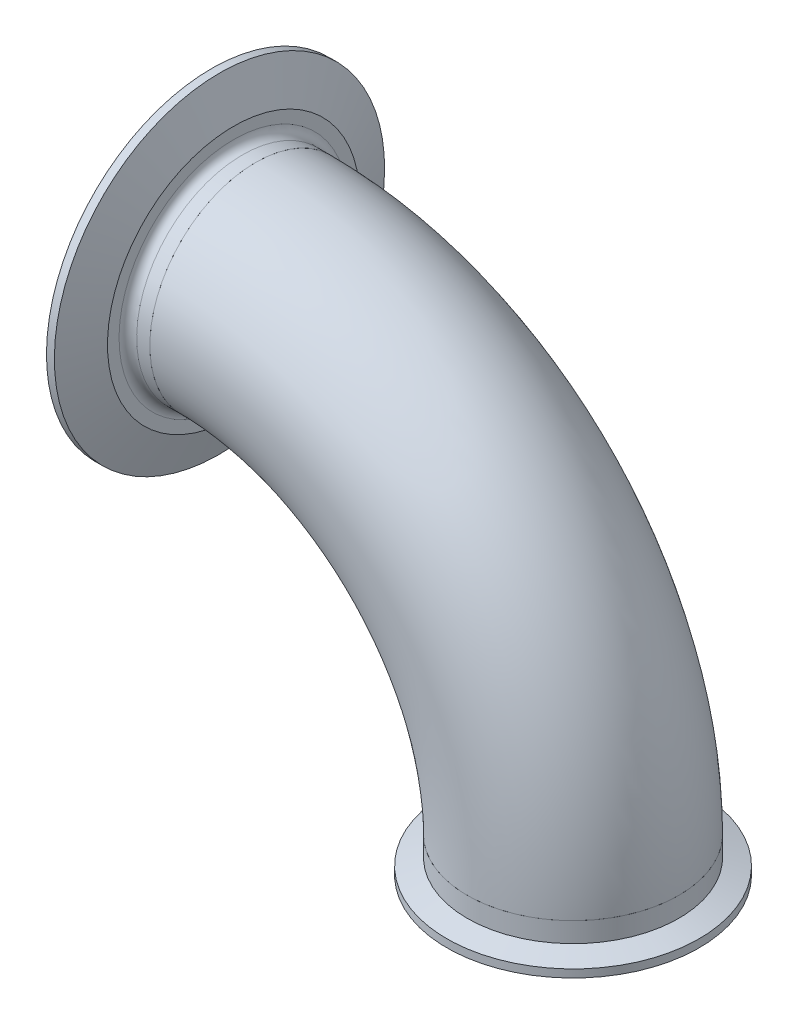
ISO-10303-21;
HEADER;
FILE_DESCRIPTION(('STEP AP214'),'2;1');
FILE_NAME('part.step','',(''),(''),'','','');
FILE_SCHEMA(('AUTOMOTIVE_DESIGN { 1 0 10303 214 1 1 1 1 }'));
ENDSEC;
DATA;
#1=APPLICATION_CONTEXT('core data for automotive mechanical design processes');
#2=APPLICATION_PROTOCOL_DEFINITION('international standard','automotive_design',2000,#1);
#3=PRODUCT_CONTEXT('',#1,'mechanical');
#4=PRODUCT('Part','Part','',(#3));
#5=PRODUCT_RELATED_PRODUCT_CATEGORY('part','',(#4));
#6=PRODUCT_DEFINITION_FORMATION('','',#4);
#7=PRODUCT_DEFINITION_CONTEXT('part definition',#1,'design');
#8=PRODUCT_DEFINITION('design','',#6,#7);
#9=PRODUCT_DEFINITION_SHAPE('','',#8);
#10=(LENGTH_UNIT() NAMED_UNIT(*) SI_UNIT(.MILLI.,.METRE.));
#11=(NAMED_UNIT(*) PLANE_ANGLE_UNIT() SI_UNIT($,.RADIAN.));
#12=(NAMED_UNIT(*) SI_UNIT($,.STERADIAN.) SOLID_ANGLE_UNIT());
#13=UNCERTAINTY_MEASURE_WITH_UNIT(LENGTH_MEASURE(1.E-05),#10,'distance_accuracy_value','');
#14=(GEOMETRIC_REPRESENTATION_CONTEXT(3) GLOBAL_UNCERTAINTY_ASSIGNED_CONTEXT((#13)) GLOBAL_UNIT_ASSIGNED_CONTEXT((#10,
#11,#12)) REPRESENTATION_CONTEXT('',''));
#15=CARTESIAN_POINT('',(0.,0.,0.));
#16=DIRECTION('',(0.,0.,1.));
#17=DIRECTION('',(1.,0.,0.));
#18=AXIS2_PLACEMENT_3D('',#15,#16,#17);
#19=CARTESIAN_POINT('',(23.2453005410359,191.163161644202,175.928638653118));
#20=DIRECTION('',(-1.,0.,0.));
#21=DIRECTION('',(0.,0.487244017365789,-0.873265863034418));
#22=AXIS2_PLACEMENT_3D('',#19,#20,#21);
#23=PLANE('',#22);
#24=CARTESIAN_POINT('',(23.2453005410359,159.33349420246,158.169081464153));
#25=DIRECTION('',(-1.,0.,0.));
#26=DIRECTION('',(0.,0.487244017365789,-0.873265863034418));
#27=AXIS2_PLACEMENT_3D('',#24,#25,#26);
#28=CIRCLE('',#27,38.1);
#29=CARTESIAN_POINT('',(23.2453005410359,177.897491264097,124.897652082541));
#30=VERTEX_POINT('',#29);
#31=EDGE_CURVE('P0_E9',#30,#30,#28,.T.);
#32=ORIENTED_EDGE('',*,*,#31,.F.);
#33=EDGE_LOOP('',(#32));
#34=FACE_BOUND('',#33,.T.);
#35=CARTESIAN_POINT('',(23.2453005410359,159.33349420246,158.169081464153));
#36=DIRECTION('',(-1.,0.,0.));
#37=DIRECTION('',(0.,0.487244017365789,-0.873265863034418));
#38=AXIS2_PLACEMENT_3D('',#35,#36,#37);
#39=CIRCLE('',#38,36.449);
#40=CARTESIAN_POINT('',(23.2453005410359,177.093051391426,126.339414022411));
#41=VERTEX_POINT('',#40);
#42=EDGE_CURVE('P0_E63',#41,#41,#39,.T.);
#43=ORIENTED_EDGE('',*,*,#42,.T.);
#44=EDGE_LOOP('',(#43));
#45=FACE_BOUND('',#44,.T.);
#46=ADVANCED_FACE('P0_F14',(#34,#45),#23,.F.);
#47=CARTESIAN_POINT('',(7.37030054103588,159.33349420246,158.169081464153));
#48=DIRECTION('',(-1.,0.,0.));
#49=DIRECTION('',(0.,0.487244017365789,-0.873265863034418));
#50=AXIS2_PLACEMENT_3D('',#47,#48,#49);
#51=CYLINDRICAL_SURFACE('',#50,38.1);
#52=CARTESIAN_POINT('',(18.4955005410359,159.33349420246,158.169081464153));
#53=DIRECTION('',(-1.,0.,0.));
#54=DIRECTION('',(0.,0.487244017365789,-0.873265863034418));
#55=AXIS2_PLACEMENT_3D('',#52,#53,#54);
#56=CIRCLE('',#55,38.1);
#57=CARTESIAN_POINT('',(18.4955005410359,177.897491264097,124.897652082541));
#58=VERTEX_POINT('',#57);
#59=EDGE_CURVE('P0_E20',#58,#58,#56,.T.);
#60=ORIENTED_EDGE('',*,*,#59,.F.);
#61=EDGE_LOOP('',(#60));
#62=FACE_BOUND('',#61,.T.);
#63=ORIENTED_EDGE('',*,*,#31,.T.);
#64=EDGE_LOOP('',(#63));
#65=FACE_BOUND('',#64,.T.);
#66=ADVANCED_FACE('P0_F142',(#62,#65),#51,.T.);
#67=CARTESIAN_POINT('',(18.4955005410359,159.33349420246,158.169081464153));
#68=DIRECTION('',(-1.,0.,0.));
#69=DIRECTION('',(0.,0.487244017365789,-0.873265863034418));
#70=AXIS2_PLACEMENT_3D('',#67,#68,#69);
#71=TOROIDAL_SURFACE('',#70,41.275,3.175);
#72=CARTESIAN_POINT('',(15.3205005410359,159.33349420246,158.169081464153));
#73=DIRECTION('',(-1.,0.,0.));
#74=DIRECTION('',(0.,0.487244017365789,-0.873265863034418));
#75=AXIS2_PLACEMENT_3D('',#72,#73,#74);
#76=CIRCLE('',#75,41.275);
#77=CARTESIAN_POINT('',(15.3205005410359,179.444491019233,122.125032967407));
#78=VERTEX_POINT('',#77);
#79=EDGE_CURVE('P0_E24',#78,#78,#76,.T.);
#80=ORIENTED_EDGE('',*,*,#79,.F.);
#81=EDGE_LOOP('',(#80));
#82=FACE_BOUND('',#81,.T.);
#83=ORIENTED_EDGE('',*,*,#59,.T.);
#84=EDGE_LOOP('',(#83));
#85=FACE_BOUND('',#84,.T.);
#86=ADVANCED_FACE('P0_F137',(#82,#85),#71,.F.);
#87=CARTESIAN_POINT('',(15.3205005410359,195.377542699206,178.280078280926));
#88=DIRECTION('',(-1.,0.,0.));
#89=DIRECTION('',(0.,0.487244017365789,-0.873265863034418));
#90=AXIS2_PLACEMENT_3D('',#87,#88,#89);
#91=PLANE('',#90);
#92=CARTESIAN_POINT('',(15.3205005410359,159.33349420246,158.169081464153));
#93=DIRECTION('',(-1.,0.,0.));
#94=DIRECTION('',(0.,0.487244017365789,-0.873265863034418));
#95=AXIS2_PLACEMENT_3D('',#92,#93,#94);
#96=CIRCLE('',#95,45.4344287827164);
#97=CARTESIAN_POINT('',(15.3205005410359,181.471147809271,118.492745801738));
#98=VERTEX_POINT('',#97);
#99=EDGE_CURVE('P0_E28',#98,#98,#96,.T.);
#100=ORIENTED_EDGE('',*,*,#99,.F.);
#101=EDGE_LOOP('',(#100));
#102=FACE_BOUND('',#101,.T.);
#103=ORIENTED_EDGE('',*,*,#79,.T.);
#104=EDGE_LOOP('',(#103));
#105=FACE_BOUND('',#104,.T.);
#106=ADVANCED_FACE('P0_F131',(#102,#105),#91,.F.);
#107=CARTESIAN_POINT('',(15.3205005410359,159.33349420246,158.169081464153));
#108=DIRECTION('',(-1.,0.,0.));
#109=DIRECTION('',(0.,0.487244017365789,-0.873265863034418));
#110=AXIS2_PLACEMENT_3D('',#107,#108,#109);
#111=CONICAL_SURFACE('',#110,45.4344287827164,1.22173047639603);
#112=CARTESIAN_POINT('',(10.2151005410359,159.33349420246,158.169081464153));
#113=DIRECTION('',(-1.,0.,0.));
#114=DIRECTION('',(0.,0.487244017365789,-0.873265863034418));
#115=AXIS2_PLACEMENT_3D('',#112,#113,#114);
#116=CIRCLE('',#115,59.4614);
#117=CARTESIAN_POINT('',(10.2151005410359,188.305705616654,106.243470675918));
#118=VERTEX_POINT('',#117);
#119=EDGE_CURVE('P0_E33',#118,#118,#116,.T.);
#120=ORIENTED_EDGE('',*,*,#119,.F.);
#121=EDGE_LOOP('',(#120));
#122=FACE_BOUND('',#121,.T.);
#123=ORIENTED_EDGE('',*,*,#99,.T.);
#124=EDGE_LOOP('',(#123));
#125=FACE_BOUND('',#124,.T.);
#126=ADVANCED_FACE('P0_F125',(#122,#125),#111,.T.);
#127=CARTESIAN_POINT('',(7.37030054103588,159.33349420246,158.169081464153));
#128=DIRECTION('',(-1.,0.,0.));
#129=DIRECTION('',(0.,0.487244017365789,-0.873265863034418));
#130=AXIS2_PLACEMENT_3D('',#127,#128,#129);
#131=CYLINDRICAL_SURFACE('',#130,59.4614);
#132=CARTESIAN_POINT('',(7.37030054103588,159.33349420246,158.169081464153));
#133=DIRECTION('',(-1.,0.,0.));
#134=DIRECTION('',(0.,0.487244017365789,-0.873265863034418));
#135=AXIS2_PLACEMENT_3D('',#132,#133,#134);
#136=CIRCLE('',#135,59.4614);
#137=CARTESIAN_POINT('',(7.37030054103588,188.305705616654,106.243470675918));
#138=VERTEX_POINT('',#137);
#139=EDGE_CURVE('P0_E36',#138,#138,#136,.T.);
#140=ORIENTED_EDGE('',*,*,#139,.F.);
#141=EDGE_LOOP('',(#140));
#142=FACE_BOUND('',#141,.T.);
#143=ORIENTED_EDGE('',*,*,#119,.T.);
#144=EDGE_LOOP('',(#143));
#145=FACE_BOUND('',#144,.T.);
#146=ADVANCED_FACE('P0_F119',(#142,#145),#131,.T.);
#147=CARTESIAN_POINT('',(7.37030054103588,211.259104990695,187.141292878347));
#148=DIRECTION('',(1.,0.,0.));
#149=DIRECTION('',(0.,-0.487244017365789,0.873265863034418));
#150=AXIS2_PLACEMENT_3D('',#147,#148,#149);
#151=PLANE('',#150);
#152=CARTESIAN_POINT('',(7.37030054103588,159.33349420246,158.169081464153));
#153=DIRECTION('',(-1.,0.,0.));
#154=DIRECTION('',(0.,0.487244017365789,-0.873265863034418));
#155=AXIS2_PLACEMENT_3D('',#152,#153,#154);
#156=CIRCLE('',#155,56.924857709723);
#157=CARTESIAN_POINT('',(7.37030054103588,187.069790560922,108.45854646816));
#158=VERTEX_POINT('',#157);
#159=EDGE_CURVE('P0_E39',#158,#158,#156,.T.);
#160=ORIENTED_EDGE('',*,*,#159,.F.);
#161=EDGE_LOOP('',(#160));
#162=FACE_BOUND('',#161,.T.);
#163=ORIENTED_EDGE('',*,*,#139,.T.);
#164=EDGE_LOOP('',(#163));
#165=FACE_BOUND('',#164,.T.);
#166=ADVANCED_FACE('P0_F113',(#162,#165),#151,.F.);
#167=CARTESIAN_POINT('',(8.14701976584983,159.33349420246,158.169081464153));
#168=DIRECTION('',(-1.,0.,0.));
#169=DIRECTION('',(0.,0.487244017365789,-0.873265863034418));
#170=AXIS2_PLACEMENT_3D('',#167,#168,#169);
#171=TOROIDAL_SURFACE('',#170,56.7956059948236,0.787400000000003);
#172=CARTESIAN_POINT('',(7.83935807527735,159.33349420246,158.169081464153));
#173=DIRECTION('',(-1.,0.,0.));
#174=DIRECTION('',(0.,0.487244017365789,-0.873265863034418));
#175=AXIS2_PLACEMENT_3D('',#172,#173,#174);
#176=CIRCLE('',#175,56.0708004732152);
#177=CARTESIAN_POINT('',(7.83935807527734,186.653656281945,109.20436549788));
#178=VERTEX_POINT('',#177);
#179=EDGE_CURVE('P0_E42',#178,#178,#176,.T.);
#180=ORIENTED_EDGE('',*,*,#179,.F.);
#181=EDGE_LOOP('',(#180));
#182=FACE_BOUND('',#181,.T.);
#183=ORIENTED_EDGE('',*,*,#159,.T.);
#184=EDGE_LOOP('',(#183));
#185=FACE_BOUND('',#184,.T.);
#186=ADVANCED_FACE('P0_F107',(#182,#185),#171,.T.);
#187=CARTESIAN_POINT('',(7.83935807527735,159.33349420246,158.169081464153));
#188=DIRECTION('',(-1.,0.,0.));
#189=DIRECTION('',(0.,0.487244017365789,-0.873265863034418));
#190=AXIS2_PLACEMENT_3D('',#187,#188,#189);
#191=CONICAL_SURFACE('',#190,56.0708004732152,0.401425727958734);
#192=CARTESIAN_POINT('',(8.24315536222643,159.33349420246,158.169081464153));
#193=DIRECTION('',(-1.,0.,0.));
#194=DIRECTION('',(0.,0.487244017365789,-0.873265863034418));
#195=AXIS2_PLACEMENT_3D('',#192,#193,#194);
#196=CIRCLE('',#195,55.8993986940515);
#197=CARTESIAN_POINT('',(8.24315536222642,186.570141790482,109.354044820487));
#198=VERTEX_POINT('',#197);
#199=EDGE_CURVE('P0_E45',#198,#198,#196,.T.);
#200=ORIENTED_EDGE('',*,*,#199,.F.);
#201=EDGE_LOOP('',(#200));
#202=FACE_BOUND('',#201,.T.);
#203=ORIENTED_EDGE('',*,*,#179,.T.);
#204=EDGE_LOOP('',(#203));
#205=FACE_BOUND('',#204,.T.);
#206=ADVANCED_FACE('P0_F101',(#202,#205),#191,.F.);
#207=CARTESIAN_POINT('',(7.77670054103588,159.33349420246,158.169081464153));
#208=DIRECTION('',(-1.,0.,0.));
#209=DIRECTION('',(0.,0.487244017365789,-0.873265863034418));
#210=AXIS2_PLACEMENT_3D('',#207,#208,#209);
#211=TOROIDAL_SURFACE('',#210,54.8005,1.1938);
#212=CARTESIAN_POINT('',(8.24315536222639,159.33349420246,158.169081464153));
#213=DIRECTION('',(-1.,0.,0.));
#214=DIRECTION('',(0.,0.487244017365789,-0.873265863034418));
#215=AXIS2_PLACEMENT_3D('',#212,#213,#214);
#216=CIRCLE('',#215,53.7016013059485);
#217=CARTESIAN_POINT('',(8.24315536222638,185.499278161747,111.273306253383));
#218=VERTEX_POINT('',#217);
#219=EDGE_CURVE('P0_E48',#218,#218,#216,.T.);
#220=ORIENTED_EDGE('',*,*,#219,.F.);
#221=EDGE_LOOP('',(#220));
#222=FACE_BOUND('',#221,.T.);
#223=ORIENTED_EDGE('',*,*,#199,.T.);
#224=EDGE_LOOP('',(#223));
#225=FACE_BOUND('',#224,.T.);
#226=ADVANCED_FACE('P0_F95',(#222,#225),#211,.F.);
#227=CARTESIAN_POINT('',(8.24315536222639,159.33349420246,158.169081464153));
#228=DIRECTION('',(1.,0.,0.));
#229=DIRECTION('',(0.,-0.487244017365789,0.873265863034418));
#230=AXIS2_PLACEMENT_3D('',#227,#228,#229);
#231=CONICAL_SURFACE('',#230,53.7016013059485,0.401425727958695);
#232=CARTESIAN_POINT('',(7.85003885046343,159.33349420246,158.169081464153));
#233=DIRECTION('',(-1.,0.,0.));
#234=DIRECTION('',(0.,0.487244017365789,-0.873265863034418));
#235=AXIS2_PLACEMENT_3D('',#232,#233,#234);
#236=CIRCLE('',#235,53.5347332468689);
#237=CARTESIAN_POINT('',(7.85003885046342,185.417972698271,111.419026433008));
#238=VERTEX_POINT('',#237);
#239=EDGE_CURVE('P0_E51',#238,#238,#236,.T.);
#240=ORIENTED_EDGE('',*,*,#239,.F.);
#241=EDGE_LOOP('',(#240));
#242=FACE_BOUND('',#241,.T.);
#243=ORIENTED_EDGE('',*,*,#219,.T.);
#244=EDGE_LOOP('',(#243));
#245=FACE_BOUND('',#244,.T.);
#246=ADVANCED_FACE('P0_F89',(#242,#245),#231,.T.);
#247=CARTESIAN_POINT('',(8.15770054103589,159.33349420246,158.169081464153));
#248=DIRECTION('',(-1.,0.,0.));
#249=DIRECTION('',(0.,0.487244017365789,-0.873265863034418));
#250=AXIS2_PLACEMENT_3D('',#247,#248,#249);
#251=TOROIDAL_SURFACE('',#250,52.8099277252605,0.787399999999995);
#252=CARTESIAN_POINT('',(7.37030054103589,159.33349420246,158.169081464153));
#253=DIRECTION('',(-1.,0.,0.));
#254=DIRECTION('',(0.,0.487244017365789,-0.873265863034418));
#255=AXIS2_PLACEMENT_3D('',#252,#253,#254);
#256=CIRCLE('',#255,52.8099277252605);
#257=CARTESIAN_POINT('',(7.37030054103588,185.064815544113,112.051974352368));
#258=VERTEX_POINT('',#257);
#259=EDGE_CURVE('P0_E54',#258,#258,#256,.T.);
#260=ORIENTED_EDGE('',*,*,#259,.F.);
#261=EDGE_LOOP('',(#260));
#262=FACE_BOUND('',#261,.T.);
#263=ORIENTED_EDGE('',*,*,#239,.T.);
#264=EDGE_LOOP('',(#263));
#265=FACE_BOUND('',#264,.T.);
#266=ADVANCED_FACE('P0_F83',(#262,#265),#251,.T.);
#267=CARTESIAN_POINT('',(7.37030054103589,201.85438095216,181.893869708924));
#268=DIRECTION('',(1.,0.,0.));
#269=DIRECTION('',(0.,-0.487244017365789,0.873265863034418));
#270=AXIS2_PLACEMENT_3D('',#267,#268,#269);
#271=PLANE('',#270);
#272=CARTESIAN_POINT('',(7.37030054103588,159.33349420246,158.169081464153));
#273=DIRECTION('',(-1.,0.,0.));
#274=DIRECTION('',(0.,0.487244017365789,-0.873265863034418));
#275=AXIS2_PLACEMENT_3D('',#272,#273,#274);
#276=CIRCLE('',#275,48.6918);
#277=CARTESIAN_POINT('',(7.37030054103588,183.058282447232,115.648194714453));
#278=VERTEX_POINT('',#277);
#279=EDGE_CURVE('P0_E57',#278,#278,#276,.T.);
#280=ORIENTED_EDGE('',*,*,#279,.F.);
#281=EDGE_LOOP('',(#280));
#282=FACE_BOUND('',#281,.T.);
#283=ORIENTED_EDGE('',*,*,#259,.T.);
#284=EDGE_LOOP('',(#283));
#285=FACE_BOUND('',#284,.T.);
#286=ADVANCED_FACE('P0_F77',(#282,#285),#271,.F.);
#287=CARTESIAN_POINT('',(7.37030054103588,159.33349420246,158.169081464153));
#288=DIRECTION('',(-1.,0.,0.));
#289=DIRECTION('',(0.,0.487244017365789,-0.873265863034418));
#290=AXIS2_PLACEMENT_3D('',#287,#288,#289);
#291=CONICAL_SURFACE('',#290,48.6918,0.958185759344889);
#292=CARTESIAN_POINT('',(15.9746844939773,159.33349420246,158.169081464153));
#293=DIRECTION('',(-1.,0.,0.));
#294=DIRECTION('',(0.,0.487244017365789,-0.873265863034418));
#295=AXIS2_PLACEMENT_3D('',#292,#293,#294);
#296=CIRCLE('',#295,36.449);
#297=CARTESIAN_POINT('',(15.9746844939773,177.093051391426,126.339414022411));
#298=VERTEX_POINT('',#297);
#299=EDGE_CURVE('P0_E60',#298,#298,#296,.T.);
#300=ORIENTED_EDGE('',*,*,#299,.F.);
#301=EDGE_LOOP('',(#300));
#302=FACE_BOUND('',#301,.T.);
#303=ORIENTED_EDGE('',*,*,#279,.T.);
#304=EDGE_LOOP('',(#303));
#305=FACE_BOUND('',#304,.T.);
#306=ADVANCED_FACE('P0_F71',(#302,#305),#291,.F.);
#307=CARTESIAN_POINT('',(7.37030054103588,159.33349420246,158.169081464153));
#308=DIRECTION('',(-1.,0.,0.));
#309=DIRECTION('',(0.,0.487244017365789,-0.873265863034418));
#310=AXIS2_PLACEMENT_3D('',#307,#308,#309);
#311=CYLINDRICAL_SURFACE('',#310,36.449);
#312=ORIENTED_EDGE('',*,*,#42,.F.);
#313=EDGE_LOOP('',(#312));
#314=FACE_BOUND('',#313,.T.);
#315=ORIENTED_EDGE('',*,*,#299,.T.);
#316=EDGE_LOOP('',(#315));
#317=FACE_BOUND('',#316,.T.);
#318=ADVANCED_FACE('P0_F68',(#314,#317),#311,.F.);
#319=CLOSED_SHELL('',(#46,#66,#86,#106,#126,#146,#166,#186,#206,#226,#246,#266,#286,#306,#318));
#320=MANIFOLD_SOLID_BREP('P0_B1',#319);
#321=CARTESIAN_POINT('',(137.545300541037,33.1208942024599,158.169081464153));
#322=DIRECTION('',(0.,-1.00000000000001,0.));
#323=DIRECTION('',(0.,0.,-1.));
#324=AXIS2_PLACEMENT_3D('',#321,#322,#323);
#325=TOROIDAL_SURFACE('',#324,43.4867084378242,0.787400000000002);
#326=CARTESIAN_POINT('',(137.545300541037,32.3334942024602,158.169081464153));
#327=DIRECTION('',(0.,-1.00000000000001,0.));
#328=DIRECTION('',(0.,0.,-1.));
#329=AXIS2_PLACEMENT_3D('',#326,#327,#328);
#330=CIRCLE('',#329,43.4867084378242);
#331=CARTESIAN_POINT('',(137.545300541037,32.3334942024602,114.682373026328));
#332=VERTEX_POINT('',#331);
#333=EDGE_CURVE('P1_E49',#332,#332,#330,.T.);
#334=ORIENTED_EDGE('',*,*,#333,.T.);
#335=EDGE_LOOP('',(#334));
#336=FACE_BOUND('',#335,.T.);
#337=CARTESIAN_POINT('',(137.545300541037,32.8079531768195,158.169081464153));
#338=DIRECTION('',(0.,-1.00000000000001,0.));
#339=DIRECTION('',(0.,0.,-1.));
#340=AXIS2_PLACEMENT_3D('',#337,#338,#339);
#341=CIRCLE('',#340,42.7641666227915);
#342=CARTESIAN_POINT('',(137.545300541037,32.8079531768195,115.404914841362));
#343=VERTEX_POINT('',#342);
#344=EDGE_CURVE('P1_E10',#343,#343,#341,.T.);
#345=ORIENTED_EDGE('',*,*,#344,.F.);
#346=EDGE_LOOP('',(#345));
#347=FACE_BOUND('',#346,.T.);
#348=ADVANCED_FACE('P1_F15',(#336,#347),#325,.T.);
#349=CARTESIAN_POINT('',(137.545300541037,32.3334942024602,158.169081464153));
#350=DIRECTION('',(0.,-1.00000000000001,0.));
#351=DIRECTION('',(0.,0.,-1.));
#352=AXIS2_PLACEMENT_3D('',#349,#350,#351);
#353=TOROIDAL_SURFACE('',#352,41.6687,1.1938);
#354=CARTESIAN_POINT('',(137.545300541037,32.8079531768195,158.169081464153));
#355=DIRECTION('',(0.,-1.00000000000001,0.));
#356=DIRECTION('',(0.,0.,-1.));
#357=AXIS2_PLACEMENT_3D('',#354,#355,#356);
#358=CIRCLE('',#357,40.5732333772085);
#359=CARTESIAN_POINT('',(137.545300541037,32.8079531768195,117.595848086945));
#360=VERTEX_POINT('',#359);
#361=EDGE_CURVE('P1_E21',#360,#360,#358,.T.);
#362=ORIENTED_EDGE('',*,*,#361,.F.);
#363=EDGE_LOOP('',(#362));
#364=FACE_BOUND('',#363,.T.);
#365=ORIENTED_EDGE('',*,*,#344,.T.);
#366=EDGE_LOOP('',(#365));
#367=FACE_BOUND('',#366,.T.);
#368=ADVANCED_FACE('P1_F98',(#364,#367),#353,.F.);
#369=CARTESIAN_POINT('',(137.545300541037,33.1208942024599,158.169081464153));
#370=DIRECTION('',(0.,-1.00000000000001,0.));
#371=DIRECTION('',(0.,0.,-1.));
#372=AXIS2_PLACEMENT_3D('',#369,#370,#371);
#373=TOROIDAL_SURFACE('',#372,39.8506915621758,0.787399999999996);
#374=ORIENTED_EDGE('',*,*,#361,.T.);
#375=EDGE_LOOP('',(#374));
#376=FACE_BOUND('',#375,.T.);
#377=CARTESIAN_POINT('',(137.545300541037,32.3334942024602,158.169081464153));
#378=DIRECTION('',(0.,-1.00000000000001,0.));
#379=DIRECTION('',(0.,0.,-1.));
#380=AXIS2_PLACEMENT_3D('',#377,#378,#379);
#381=CIRCLE('',#380,39.8506915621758);
#382=CARTESIAN_POINT('',(137.545300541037,32.3334942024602,118.318389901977));
#383=VERTEX_POINT('',#382);
#384=EDGE_CURVE('P1_E25',#383,#383,#381,.T.);
#385=ORIENTED_EDGE('',*,*,#384,.F.);
#386=EDGE_LOOP('',(#385));
#387=FACE_BOUND('',#386,.T.);
#388=ADVANCED_FACE('P1_F94',(#376,#387),#373,.T.);
#389=CARTESIAN_POINT('',(137.545300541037,32.3334942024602,158.169081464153));
#390=DIRECTION('',(0.,1.00000000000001,0.));
#391=DIRECTION('',(0.,0.,1.));
#392=AXIS2_PLACEMENT_3D('',#389,#390,#391);
#393=PLANE('',#392);
#394=CARTESIAN_POINT('',(137.545300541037,32.3334942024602,158.169081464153));
#395=DIRECTION('',(0.,-1.00000000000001,0.));
#396=DIRECTION('',(0.,0.,-1.));
#397=AXIS2_PLACEMENT_3D('',#394,#395,#396);
#398=CIRCLE('',#397,36.449);
#399=CARTESIAN_POINT('',(137.545300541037,32.3334942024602,121.720081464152));
#400=VERTEX_POINT('',#399);
#401=EDGE_CURVE('P1_E29',#400,#400,#398,.T.);
#402=ORIENTED_EDGE('',*,*,#401,.F.);
#403=EDGE_LOOP('',(#402));
#404=FACE_BOUND('',#403,.T.);
#405=ORIENTED_EDGE('',*,*,#384,.T.);
#406=EDGE_LOOP('',(#405));
#407=FACE_BOUND('',#406,.T.);
#408=ADVANCED_FACE('P1_F87',(#404,#407),#393,.F.);
#409=CARTESIAN_POINT('',(137.545300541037,32.3334942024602,158.169081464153));
#410=DIRECTION('',(0.,-1.00000000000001,0.));
#411=DIRECTION('',(0.,0.,-1.));
#412=AXIS2_PLACEMENT_3D('',#409,#410,#411);
#413=CYLINDRICAL_SURFACE('',#412,36.449);
#414=ORIENTED_EDGE('',*,*,#401,.T.);
#415=EDGE_LOOP('',(#414));
#416=FACE_BOUND('',#415,.T.);
#417=CARTESIAN_POINT('',(137.545300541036,45.0334942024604,158.169081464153));
#418=DIRECTION('',(0.,-1.00000000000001,0.));
#419=DIRECTION('',(0.,0.,-1.));
#420=AXIS2_PLACEMENT_3D('',#417,#418,#419);
#421=CIRCLE('',#420,36.449);
#422=CARTESIAN_POINT('',(137.545300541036,45.0334942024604,121.720081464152));
#423=VERTEX_POINT('',#422);
#424=EDGE_CURVE('P1_E34',#423,#423,#421,.T.);
#425=ORIENTED_EDGE('',*,*,#424,.F.);
#426=EDGE_LOOP('',(#425));
#427=FACE_BOUND('',#426,.T.);
#428=ADVANCED_FACE('P1_F82',(#416,#427),#413,.F.);
#429=CARTESIAN_POINT('',(137.545300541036,45.0334942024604,158.169081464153));
#430=DIRECTION('',(0.,-1.00000000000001,0.));
#431=DIRECTION('',(0.,0.,-1.));
#432=AXIS2_PLACEMENT_3D('',#429,#430,#431);
#433=PLANE('',#432);
#434=CARTESIAN_POINT('',(137.545300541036,45.0334942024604,158.169081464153));
#435=DIRECTION('',(0.,-1.00000000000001,0.));
#436=DIRECTION('',(0.,0.,-1.));
#437=AXIS2_PLACEMENT_3D('',#434,#435,#436);
#438=CIRCLE('',#437,38.1);
#439=CARTESIAN_POINT('',(137.545300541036,45.0334942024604,120.069081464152));
#440=VERTEX_POINT('',#439);
#441=EDGE_CURVE('P1_E37',#440,#440,#438,.T.);
#442=ORIENTED_EDGE('',*,*,#441,.F.);
#443=EDGE_LOOP('',(#442));
#444=FACE_BOUND('',#443,.T.);
#445=ORIENTED_EDGE('',*,*,#424,.T.);
#446=EDGE_LOOP('',(#445));
#447=FACE_BOUND('',#446,.T.);
#448=ADVANCED_FACE('P1_F76',(#444,#447),#433,.F.);
#449=CARTESIAN_POINT('',(137.545300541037,32.3334942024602,158.169081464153));
#450=DIRECTION('',(0.,-1.00000000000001,0.));
#451=DIRECTION('',(0.,0.,-1.));
#452=AXIS2_PLACEMENT_3D('',#449,#450,#451);
#453=CYLINDRICAL_SURFACE('',#452,38.1);
#454=CARTESIAN_POINT('',(137.545300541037,37.8546765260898,158.169081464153));
#455=DIRECTION('',(0.,-1.00000000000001,0.));
#456=DIRECTION('',(0.,0.,-1.));
#457=AXIS2_PLACEMENT_3D('',#454,#455,#456);
#458=CIRCLE('',#457,38.1);
#459=CARTESIAN_POINT('',(137.545300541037,37.8546765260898,120.069081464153));
#460=VERTEX_POINT('',#459);
#461=EDGE_CURVE('P1_E40',#460,#460,#458,.T.);
#462=ORIENTED_EDGE('',*,*,#461,.F.);
#463=EDGE_LOOP('',(#462));
#464=FACE_BOUND('',#463,.T.);
#465=ORIENTED_EDGE('',*,*,#441,.T.);
#466=EDGE_LOOP('',(#465));
#467=FACE_BOUND('',#466,.T.);
#468=ADVANCED_FACE('P1_F70',(#464,#467),#453,.T.);
#469=CARTESIAN_POINT('',(137.545300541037,37.8546765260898,158.169081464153));
#470=DIRECTION('',(0.,-1.00000000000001,0.));
#471=DIRECTION('',(0.,0.,-1.));
#472=AXIS2_PLACEMENT_3D('',#469,#470,#471);
#473=CONICAL_SURFACE('',#472,38.1,1.22173047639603);
#474=CARTESIAN_POINT('',(137.545300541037,35.1782942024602,158.169081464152));
#475=DIRECTION('',(0.,-1.00000000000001,0.));
#476=DIRECTION('',(0.,0.,-1.));
#477=AXIS2_PLACEMENT_3D('',#474,#475,#476);
#478=CIRCLE('',#477,45.4533);
#479=CARTESIAN_POINT('',(137.545300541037,35.1782942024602,112.715781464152));
#480=VERTEX_POINT('',#479);
#481=EDGE_CURVE('P1_E43',#480,#480,#478,.T.);
#482=ORIENTED_EDGE('',*,*,#481,.F.);
#483=EDGE_LOOP('',(#482));
#484=FACE_BOUND('',#483,.T.);
#485=ORIENTED_EDGE('',*,*,#461,.T.);
#486=EDGE_LOOP('',(#485));
#487=FACE_BOUND('',#486,.T.);
#488=ADVANCED_FACE('P1_F64',(#484,#487),#473,.T.);
#489=CARTESIAN_POINT('',(137.545300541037,32.3334942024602,158.169081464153));
#490=DIRECTION('',(0.,-1.00000000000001,0.));
#491=DIRECTION('',(0.,0.,-1.));
#492=AXIS2_PLACEMENT_3D('',#489,#490,#491);
#493=CYLINDRICAL_SURFACE('',#492,45.4533);
#494=CARTESIAN_POINT('',(137.545300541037,32.3334942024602,158.169081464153));
#495=DIRECTION('',(0.,-1.00000000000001,0.));
#496=DIRECTION('',(0.,0.,-1.));
#497=AXIS2_PLACEMENT_3D('',#494,#495,#496);
#498=CIRCLE('',#497,45.4533);
#499=CARTESIAN_POINT('',(137.545300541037,32.3334942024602,112.715781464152));
#500=VERTEX_POINT('',#499);
#501=EDGE_CURVE('P1_E46',#500,#500,#498,.T.);
#502=ORIENTED_EDGE('',*,*,#501,.F.);
#503=EDGE_LOOP('',(#502));
#504=FACE_BOUND('',#503,.T.);
#505=ORIENTED_EDGE('',*,*,#481,.T.);
#506=EDGE_LOOP('',(#505));
#507=FACE_BOUND('',#506,.T.);
#508=ADVANCED_FACE('P1_F58',(#504,#507),#493,.T.);
#509=CARTESIAN_POINT('',(137.545300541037,32.3334942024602,158.169081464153));
#510=DIRECTION('',(0.,1.00000000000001,0.));
#511=DIRECTION('',(0.,0.,1.));
#512=AXIS2_PLACEMENT_3D('',#509,#510,#511);
#513=PLANE('',#512);
#514=ORIENTED_EDGE('',*,*,#333,.F.);
#515=EDGE_LOOP('',(#514));
#516=FACE_BOUND('',#515,.T.);
#517=ORIENTED_EDGE('',*,*,#501,.T.);
#518=EDGE_LOOP('',(#517));
#519=FACE_BOUND('',#518,.T.);
#520=ADVANCED_FACE('P1_F55',(#516,#519),#513,.F.);
#521=CLOSED_SHELL('',(#348,#368,#388,#408,#428,#448,#468,#488,#508,#520));
#522=MANIFOLD_SOLID_BREP('P1_B1',#521);
#523=CARTESIAN_POINT('',(23.2453005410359,45.0334942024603,158.169081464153));
#524=DIRECTION('',(0.,0.,-1.));
#525=DIRECTION('',(-1.,0.,0.));
#526=AXIS2_PLACEMENT_3D('',#523,#524,#525);
#527=TOROIDAL_SURFACE('',#526,114.3,36.449);
#528=CARTESIAN_POINT('',(23.2453005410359,159.33349420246,158.169081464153));
#529=DIRECTION('',(-1.,0.,0.));
#530=DIRECTION('',(0.,0.,1.));
#531=AXIS2_PLACEMENT_3D('',#528,#529,#530);
#532=CIRCLE('',#531,36.449);
#533=CARTESIAN_POINT('',(23.2453005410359,195.78249420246,158.169081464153));
#534=VERTEX_POINT('',#533);
#535=EDGE_CURVE('P2_E22',#534,#534,#532,.T.);
#536=CARTESIAN_POINT('',(137.545300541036,45.0334942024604,158.169081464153));
#537=DIRECTION('',(0.,1.,0.));
#538=DIRECTION('',(0.,0.,1.));
#539=AXIS2_PLACEMENT_3D('',#536,#537,#538);
#540=CIRCLE('',#539,36.449);
#541=CARTESIAN_POINT('',(173.994300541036,45.0334942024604,158.169081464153));
#542=VERTEX_POINT('',#541);
#543=EDGE_CURVE('P2_E30',#542,#542,#540,.T.);
#544=CARTESIAN_POINT('',(23.2453005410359,45.0334942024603,158.169081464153));
#545=DIRECTION('',(0.,0.,-1.));
#546=DIRECTION('',(-1.,0.,0.));
#547=AXIS2_PLACEMENT_3D('',#544,#545,#546);
#548=CIRCLE('',#547,150.749);
#549=EDGE_CURVE('',#534,#542,#548,.T.);
#550=ORIENTED_EDGE('',*,*,#535,.T.);
#551=ORIENTED_EDGE('',*,*,#543,.F.);
#552=ORIENTED_EDGE('',*,*,#549,.T.);
#553=ORIENTED_EDGE('',*,*,#549,.F.);
#554=EDGE_LOOP('',(#550,#552,#551,#553));
#555=FACE_BOUND('',#554,.T.);
#556=ADVANCED_FACE('P2_F15',(#555),#527,.F.);
#557=CARTESIAN_POINT('',(23.2453005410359,45.0334942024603,158.169081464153));
#558=DIRECTION('',(0.,0.,-1.));
#559=DIRECTION('',(-1.,0.,0.));
#560=AXIS2_PLACEMENT_3D('',#557,#558,#559);
#561=TOROIDAL_SURFACE('',#560,114.3,38.1);
#562=CARTESIAN_POINT('',(23.2453005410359,159.33349420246,158.169081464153));
#563=DIRECTION('',(-1.,0.,0.));
#564=DIRECTION('',(0.,0.,1.));
#565=AXIS2_PLACEMENT_3D('',#562,#563,#564);
#566=CIRCLE('',#565,38.1);
#567=CARTESIAN_POINT('',(23.2453005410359,197.43349420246,158.169081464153));
#568=VERTEX_POINT('',#567);
#569=EDGE_CURVE('P2_E10',#568,#568,#566,.T.);
#570=CARTESIAN_POINT('',(137.545300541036,45.0334942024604,158.169081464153));
#571=DIRECTION('',(0.,1.,0.));
#572=DIRECTION('',(0.,0.,1.));
#573=AXIS2_PLACEMENT_3D('',#570,#571,#572);
#574=CIRCLE('',#573,38.1);
#575=CARTESIAN_POINT('',(175.645300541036,45.0334942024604,158.169081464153));
#576=VERTEX_POINT('',#575);
#577=EDGE_CURVE('P2_E26',#576,#576,#574,.T.);
#578=CARTESIAN_POINT('',(23.2453005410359,45.0334942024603,158.169081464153));
#579=DIRECTION('',(0.,0.,-1.));
#580=DIRECTION('',(-1.,0.,0.));
#581=AXIS2_PLACEMENT_3D('',#578,#579,#580);
#582=CIRCLE('',#581,152.4);
#583=EDGE_CURVE('',#568,#576,#582,.T.);
#584=ORIENTED_EDGE('',*,*,#569,.F.);
#585=ORIENTED_EDGE('',*,*,#577,.T.);
#586=ORIENTED_EDGE('',*,*,#583,.T.);
#587=ORIENTED_EDGE('',*,*,#583,.F.);
#588=EDGE_LOOP('',(#584,#586,#585,#587));
#589=FACE_BOUND('',#588,.T.);
#590=ADVANCED_FACE('P2_F17',(#589),#561,.T.);
#591=CARTESIAN_POINT('',(23.2453005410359,159.33349420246,158.169081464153));
#592=DIRECTION('',(-1.,0.,0.));
#593=DIRECTION('',(0.,0.,1.));
#594=AXIS2_PLACEMENT_3D('',#591,#592,#593);
#595=PLANE('',#594);
#596=ORIENTED_EDGE('',*,*,#535,.F.);
#597=EDGE_LOOP('',(#596));
#598=FACE_BOUND('',#597,.T.);
#599=ORIENTED_EDGE('',*,*,#569,.T.);
#600=EDGE_LOOP('',(#599));
#601=FACE_BOUND('',#600,.T.);
#602=ADVANCED_FACE('P2_F44',(#598,#601),#595,.T.);
#603=CARTESIAN_POINT('',(137.545300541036,45.0334942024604,158.169081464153));
#604=DIRECTION('',(0.,1.,0.));
#605=DIRECTION('',(0.,0.,1.));
#606=AXIS2_PLACEMENT_3D('',#603,#604,#605);
#607=PLANE('',#606);
#608=ORIENTED_EDGE('',*,*,#543,.T.);
#609=EDGE_LOOP('',(#608));
#610=FACE_BOUND('',#609,.T.);
#611=ORIENTED_EDGE('',*,*,#577,.F.);
#612=EDGE_LOOP('',(#611));
#613=FACE_BOUND('',#612,.T.);
#614=ADVANCED_FACE('P2_F36',(#610,#613),#607,.F.);
#615=CLOSED_SHELL('',(#556,#590,#602,#614));
#616=MANIFOLD_SOLID_BREP('P2_B1',#615);
#617=ADVANCED_BREP_SHAPE_REPRESENTATION('',(#18,#320,#522,#616),#14);
#618=SHAPE_DEFINITION_REPRESENTATION(#9,#617);
ENDSEC;
END-ISO-10303-21;
